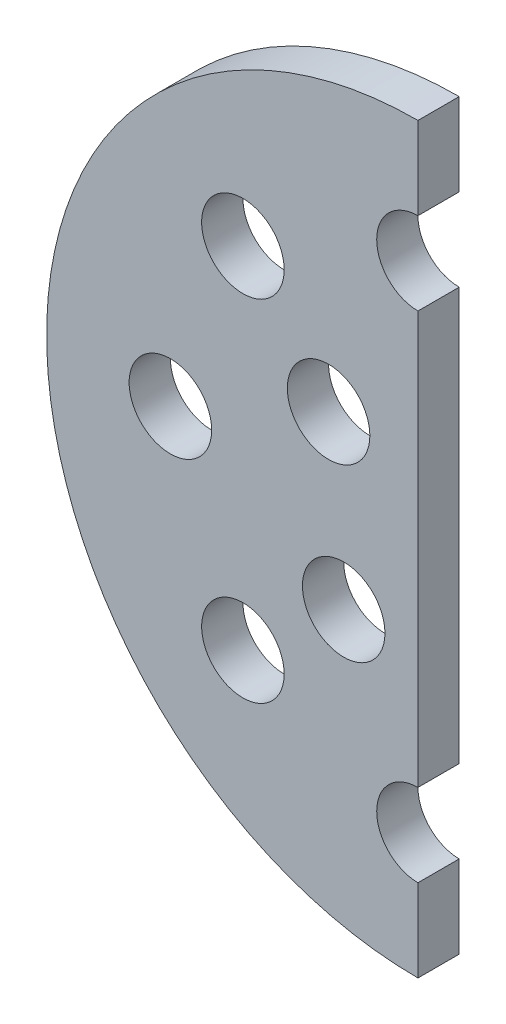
from build123d import *

# Parameters (mm, degrees)
SKETCH1_R           = 275
SKETCH1_R_2         = 25
BOSS_EXTRUDE1_DEPTH = 25
FILLET1_R           = 10
FILLET2_R           = 10
SKETCH2_R           = 336.333166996
SKETCH2_R_2         = 225
CUT_EXTRUDE3_DEPTH  = 100
CUT_EXTRUDE4_DEPTH  = 100


with BuildPart() as part:
    # Sketch1 → Boss-Extrude1 (new body)
    with BuildSketch(Plane.XY):
        Circle(SKETCH1_R)
        with Locations((0, 150)):
            Circle(SKETCH1_R_2, mode=Mode.SUBTRACT)
        with Locations((106.066017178, 106.066017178)):
            Circle(SKETCH1_R_2, mode=Mode.SUBTRACT)
        with Locations((150, 0)):
            Circle(SKETCH1_R_2, mode=Mode.SUBTRACT)
        with Locations((106.066017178, -106.066017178)):
            Circle(SKETCH1_R_2, mode=Mode.SUBTRACT)
        with Locations((0, -150)):
            Circle(SKETCH1_R_2, mode=Mode.SUBTRACT)
        with Locations((-106.066017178, -106.066017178)):
            Circle(SKETCH1_R_2, mode=Mode.SUBTRACT)
        with Locations((-150, 0)):
            Circle(SKETCH1_R_2, mode=Mode.SUBTRACT)
        with Locations((-106.066017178, 106.066017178)):
            Circle(SKETCH1_R_2, mode=Mode.SUBTRACT)
        with Locations((-54.151001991, 45)):
            Circle(SKETCH1_R_2, mode=Mode.SUBTRACT)
        with Locations((45, 54.151001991)):
            Circle(SKETCH1_R_2, mode=Mode.SUBTRACT)
        with Locations((54.151001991, -45)):
            Circle(SKETCH1_R_2, mode=Mode.SUBTRACT)
        with Locations((-45, -54.151001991)):
            Circle(SKETCH1_R_2, mode=Mode.SUBTRACT)
    extrude(amount=BOSS_EXTRUDE1_DEPTH)

    # Fillet1
    fillet1_edges = [part.edges().sort_by_distance(p)[0] for p in [
        (-275, 0, 25),
    ]]
    fillet(fillet1_edges, radius=FILLET1_R)

    # Fillet2
    fillet2_edges = [part.edges().sort_by_distance(p)[0] for p in [
        (-275, 0, 0),
    ]]
    fillet(fillet2_edges, radius=FILLET2_R)

    # Sketch2 → Cut-Extrude3 (cut)
    with BuildSketch(Plane.XY):
        Circle(SKETCH2_R)
        Circle(SKETCH2_R_2, mode=Mode.SUBTRACT)
    extrude(amount=CUT_EXTRUDE3_DEPTH, mode=Mode.SUBTRACT)

    # Sketch3 → Cut-Extrude4 (cut)
    with BuildSketch(Plane.XY):
        with BuildLine():
            Line((0, 225), (0, -225))
            ThreePointArc((0, -225), (225, 0), (0, 225))
        make_face()
    extrude(amount=CUT_EXTRUDE4_DEPTH, mode=Mode.SUBTRACT)


solid = part.part
